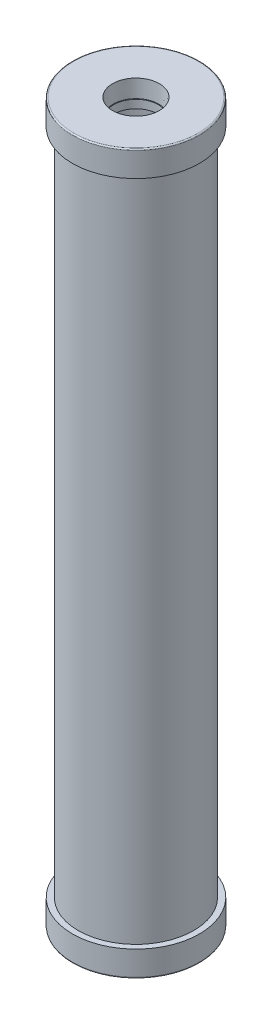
ISO-10303-21;
HEADER;
FILE_DESCRIPTION(('STEP AP214'),'2;1');
FILE_NAME('part.step','',(''),(''),'','','');
FILE_SCHEMA(('AUTOMOTIVE_DESIGN { 1 0 10303 214 1 1 1 1 }'));
ENDSEC;
DATA;
#1=APPLICATION_CONTEXT('core data for automotive mechanical design processes');
#2=APPLICATION_PROTOCOL_DEFINITION('international standard','automotive_design',2000,#1);
#3=PRODUCT_CONTEXT('',#1,'mechanical');
#4=PRODUCT('Part','Part','',(#3));
#5=PRODUCT_RELATED_PRODUCT_CATEGORY('part','',(#4));
#6=PRODUCT_DEFINITION_FORMATION('','',#4);
#7=PRODUCT_DEFINITION_CONTEXT('part definition',#1,'design');
#8=PRODUCT_DEFINITION('design','',#6,#7);
#9=PRODUCT_DEFINITION_SHAPE('','',#8);
#10=(LENGTH_UNIT() NAMED_UNIT(*) SI_UNIT(.MILLI.,.METRE.));
#11=(NAMED_UNIT(*) PLANE_ANGLE_UNIT() SI_UNIT($,.RADIAN.));
#12=(NAMED_UNIT(*) SI_UNIT($,.STERADIAN.) SOLID_ANGLE_UNIT());
#13=UNCERTAINTY_MEASURE_WITH_UNIT(LENGTH_MEASURE(1.E-05),#10,'distance_accuracy_value','');
#14=(GEOMETRIC_REPRESENTATION_CONTEXT(3) GLOBAL_UNCERTAINTY_ASSIGNED_CONTEXT((#13)) GLOBAL_UNIT_ASSIGNED_CONTEXT((#10,
#11,#12)) REPRESENTATION_CONTEXT('',''));
#15=CARTESIAN_POINT('',(0.,0.,0.));
#16=DIRECTION('',(0.,0.,1.));
#17=DIRECTION('',(1.,0.,0.));
#18=AXIS2_PLACEMENT_3D('',#15,#16,#17);
#19=CARTESIAN_POINT('',(0.,711.2,0.));
#20=DIRECTION('',(0.,-1.,0.));
#21=DIRECTION('',(0.,0.,-1.));
#22=AXIS2_PLACEMENT_3D('',#19,#20,#21);
#23=CYLINDRICAL_SURFACE('',#22,57.15);
#24=CARTESIAN_POINT('',(0.,25.4,0.));
#25=DIRECTION('',(0.,1.,0.));
#26=DIRECTION('',(0.,0.,1.));
#27=AXIS2_PLACEMENT_3D('',#24,#25,#26);
#28=CIRCLE('',#27,57.15);
#29=CARTESIAN_POINT('',(0.,25.4,57.15));
#30=VERTEX_POINT('',#29);
#31=EDGE_CURVE('E71',#30,#30,#28,.T.);
#32=ORIENTED_EDGE('',*,*,#31,.T.);
#33=EDGE_LOOP('',(#32));
#34=FACE_BOUND('',#33,.T.);
#35=CARTESIAN_POINT('',(0.,685.8,0.));
#36=DIRECTION('',(0.,1.,0.));
#37=DIRECTION('',(0.,0.,1.));
#38=AXIS2_PLACEMENT_3D('',#35,#36,#37);
#39=CIRCLE('',#38,57.15);
#40=CARTESIAN_POINT('',(0.,685.8,57.15));
#41=VERTEX_POINT('',#40);
#42=EDGE_CURVE('E53',#41,#41,#39,.T.);
#43=ORIENTED_EDGE('',*,*,#42,.F.);
#44=EDGE_LOOP('',(#43));
#45=FACE_BOUND('',#44,.T.);
#46=ADVANCED_FACE('F33',(#34,#45),#23,.T.);
#47=CARTESIAN_POINT('',(0.,711.2,0.));
#48=DIRECTION('',(0.,-1.,0.));
#49=DIRECTION('',(0.,0.,-1.));
#50=AXIS2_PLACEMENT_3D('',#47,#48,#49);
#51=CYLINDRICAL_SURFACE('',#50,50.546);
#52=CARTESIAN_POINT('',(0.,25.4,0.));
#53=DIRECTION('',(0.,1.,0.));
#54=DIRECTION('',(0.,0.,1.));
#55=AXIS2_PLACEMENT_3D('',#52,#53,#54);
#56=CIRCLE('',#55,50.546);
#57=CARTESIAN_POINT('',(0.,25.4,50.546));
#58=VERTEX_POINT('',#57);
#59=EDGE_CURVE('E68',#58,#58,#56,.T.);
#60=ORIENTED_EDGE('',*,*,#59,.F.);
#61=EDGE_LOOP('',(#60));
#62=FACE_BOUND('',#61,.T.);
#63=CARTESIAN_POINT('',(0.,685.8,0.));
#64=DIRECTION('',(0.,1.,0.));
#65=DIRECTION('',(0.,0.,1.));
#66=AXIS2_PLACEMENT_3D('',#63,#64,#65);
#67=CIRCLE('',#66,50.546);
#68=CARTESIAN_POINT('',(0.,685.8,50.546));
#69=VERTEX_POINT('',#68);
#70=EDGE_CURVE('E59',#69,#69,#67,.T.);
#71=ORIENTED_EDGE('',*,*,#70,.T.);
#72=EDGE_LOOP('',(#71));
#73=FACE_BOUND('',#72,.T.);
#74=ADVANCED_FACE('F115',(#62,#73),#51,.F.);
#75=CARTESIAN_POINT('',(0.,25.4,0.));
#76=DIRECTION('',(0.,1.,0.));
#77=DIRECTION('',(0.,0.,1.));
#78=AXIS2_PLACEMENT_3D('',#75,#76,#77);
#79=PLANE('',#78);
#80=CARTESIAN_POINT('',(0.,25.4,0.));
#81=DIRECTION('',(0.,1.,0.));
#82=DIRECTION('',(0.,0.,1.));
#83=AXIS2_PLACEMENT_3D('',#80,#81,#82);
#84=CIRCLE('',#83,21.8313);
#85=CARTESIAN_POINT('',(0.,25.4,21.8313));
#86=VERTEX_POINT('',#85);
#87=EDGE_CURVE('E63',#86,#86,#84,.T.);
#88=ORIENTED_EDGE('',*,*,#87,.F.);
#89=EDGE_LOOP('',(#88));
#90=FACE_BOUND('',#89,.T.);
#91=ORIENTED_EDGE('',*,*,#59,.T.);
#92=EDGE_LOOP('',(#91));
#93=FACE_BOUND('',#92,.T.);
#94=ADVANCED_FACE('F121',(#90,#93),#79,.T.);
#95=CARTESIAN_POINT('',(0.,25.4,0.));
#96=DIRECTION('',(0.,1.,0.));
#97=DIRECTION('',(0.,0.,1.));
#98=AXIS2_PLACEMENT_3D('',#95,#96,#97);
#99=CIRCLE('',#98,62.865);
#100=CARTESIAN_POINT('',(0.,25.4,62.865));
#101=VERTEX_POINT('',#100);
#102=EDGE_CURVE('E66',#101,#101,#99,.T.);
#103=ORIENTED_EDGE('',*,*,#102,.T.);
#104=EDGE_LOOP('',(#103));
#105=FACE_BOUND('',#104,.T.);
#106=ORIENTED_EDGE('',*,*,#31,.F.);
#107=EDGE_LOOP('',(#106));
#108=FACE_BOUND('',#107,.T.);
#109=ADVANCED_FACE('F142',(#105,#108),#79,.T.);
#110=CARTESIAN_POINT('',(0.,25.4,0.));
#111=DIRECTION('',(0.,-1.,0.));
#112=DIRECTION('',(0.,0.,-1.));
#113=AXIS2_PLACEMENT_3D('',#110,#111,#112);
#114=CYLINDRICAL_SURFACE('',#113,62.865);
#115=CARTESIAN_POINT('',(0.,1.27,0.));
#116=DIRECTION('',(0.,1.,0.));
#117=DIRECTION('',(0.,0.,1.));
#118=AXIS2_PLACEMENT_3D('',#115,#116,#117);
#119=CIRCLE('',#118,62.865);
#120=CARTESIAN_POINT('',(0.,1.27,62.865));
#121=VERTEX_POINT('',#120);
#122=EDGE_CURVE('E48',#121,#121,#119,.T.);
#123=ORIENTED_EDGE('',*,*,#122,.T.);
#124=EDGE_LOOP('',(#123));
#125=FACE_BOUND('',#124,.T.);
#126=ORIENTED_EDGE('',*,*,#102,.F.);
#127=EDGE_LOOP('',(#126));
#128=FACE_BOUND('',#127,.T.);
#129=ADVANCED_FACE('F139',(#125,#128),#114,.T.);
#130=CARTESIAN_POINT('',(0.,0.,0.));
#131=DIRECTION('',(0.,1.,0.));
#132=DIRECTION('',(0.,0.,1.));
#133=AXIS2_PLACEMENT_3D('',#130,#131,#132);
#134=PLANE('',#133);
#135=CARTESIAN_POINT('',(0.,0.,0.));
#136=DIRECTION('',(0.,1.,0.));
#137=DIRECTION('',(0.,0.,1.));
#138=AXIS2_PLACEMENT_3D('',#135,#136,#137);
#139=CIRCLE('',#138,61.595);
#140=CARTESIAN_POINT('',(0.,0.,61.595));
#141=VERTEX_POINT('',#140);
#142=EDGE_CURVE('E44',#141,#141,#139,.F.);
#143=ORIENTED_EDGE('',*,*,#142,.T.);
#144=EDGE_LOOP('',(#143));
#145=FACE_BOUND('',#144,.T.);
#146=CARTESIAN_POINT('',(0.,0.,0.));
#147=DIRECTION('',(0.,-1.,0.));
#148=DIRECTION('',(0.,0.,-1.));
#149=AXIS2_PLACEMENT_3D('',#146,#147,#148);
#150=CIRCLE('',#149,23.1430322);
#151=CARTESIAN_POINT('',(0.,0.,-23.1430322));
#152=VERTEX_POINT('',#151);
#153=EDGE_CURVE('E62',#152,#152,#150,.T.);
#154=ORIENTED_EDGE('',*,*,#153,.F.);
#155=EDGE_LOOP('',(#154));
#156=FACE_BOUND('',#155,.T.);
#157=ADVANCED_FACE('F124',(#145,#156),#134,.F.);
#158=CARTESIAN_POINT('',(0.,0.,0.));
#159=DIRECTION('',(0.,-1.,0.));
#160=DIRECTION('',(0.,0.,-1.));
#161=AXIS2_PLACEMENT_3D('',#158,#159,#160);
#162=CYLINDRICAL_SURFACE('',#161,21.8313);
#163=ORIENTED_EDGE('',*,*,#87,.T.);
#164=EDGE_LOOP('',(#163));
#165=FACE_BOUND('',#164,.T.);
#166=CARTESIAN_POINT('',(0.,17.272,0.));
#167=DIRECTION('',(0.,-1.,0.));
#168=DIRECTION('',(0.,0.,-1.));
#169=AXIS2_PLACEMENT_3D('',#166,#167,#168);
#170=CIRCLE('',#169,21.8313);
#171=CARTESIAN_POINT('',(0.,17.272,-21.8313));
#172=VERTEX_POINT('',#171);
#173=EDGE_CURVE('E67',#172,#172,#170,.T.);
#174=ORIENTED_EDGE('',*,*,#173,.T.);
#175=EDGE_LOOP('',(#174));
#176=FACE_BOUND('',#175,.T.);
#177=ADVANCED_FACE('F155',(#165,#176),#162,.F.);
#178=CARTESIAN_POINT('',(21.8313,17.272,0.));
#179=DIRECTION('',(0.,1.,0.));
#180=DIRECTION('',(0.,0.,1.));
#181=AXIS2_PLACEMENT_3D('',#178,#179,#180);
#182=PLANE('',#181);
#183=ORIENTED_EDGE('',*,*,#173,.F.);
#184=EDGE_LOOP('',(#183));
#185=FACE_BOUND('',#184,.T.);
#186=CARTESIAN_POINT('',(0.,17.272,0.));
#187=DIRECTION('',(0.,-1.,0.));
#188=DIRECTION('',(0.,0.,-1.));
#189=AXIS2_PLACEMENT_3D('',#186,#187,#188);
#190=CIRCLE('',#189,22.6258853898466);
#191=CARTESIAN_POINT('',(0.,17.272,-22.6258853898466));
#192=VERTEX_POINT('',#191);
#193=EDGE_CURVE('E78',#192,#192,#190,.T.);
#194=ORIENTED_EDGE('',*,*,#193,.T.);
#195=EDGE_LOOP('',(#194));
#196=FACE_BOUND('',#195,.T.);
#197=ADVANCED_FACE('F158',(#185,#196),#182,.F.);
#198=CARTESIAN_POINT('',(0.,0.,0.));
#199=DIRECTION('',(0.,-1.,0.));
#200=DIRECTION('',(0.,0.,-1.));
#201=AXIS2_PLACEMENT_3D('',#198,#199,#200);
#202=CONICAL_SURFACE('',#201,23.1430322,0.0299323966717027);
#203=ORIENTED_EDGE('',*,*,#193,.F.);
#204=EDGE_LOOP('',(#203));
#205=FACE_BOUND('',#204,.T.);
#206=ORIENTED_EDGE('',*,*,#153,.T.);
#207=EDGE_LOOP('',(#206));
#208=FACE_BOUND('',#207,.T.);
#209=ADVANCED_FACE('F162',(#205,#208),#202,.F.);
#210=CARTESIAN_POINT('',(0.,685.8,0.));
#211=DIRECTION('',(0.,1.,0.));
#212=DIRECTION('',(0.,0.,1.));
#213=AXIS2_PLACEMENT_3D('',#210,#211,#212);
#214=PLANE('',#213);
#215=CARTESIAN_POINT('',(0.,685.8,0.));
#216=DIRECTION('',(0.,1.,0.));
#217=DIRECTION('',(0.,0.,1.));
#218=AXIS2_PLACEMENT_3D('',#215,#216,#217);
#219=CIRCLE('',#218,21.8313);
#220=CARTESIAN_POINT('',(0.,685.8,21.8313));
#221=VERTEX_POINT('',#220);
#222=EDGE_CURVE('E54',#221,#221,#219,.T.);
#223=ORIENTED_EDGE('',*,*,#222,.T.);
#224=EDGE_LOOP('',(#223));
#225=FACE_BOUND('',#224,.T.);
#226=ORIENTED_EDGE('',*,*,#70,.F.);
#227=EDGE_LOOP('',(#226));
#228=FACE_BOUND('',#227,.T.);
#229=ADVANCED_FACE('F165',(#225,#228),#214,.F.);
#230=CARTESIAN_POINT('',(0.,685.8,0.));
#231=DIRECTION('',(0.,1.,0.));
#232=DIRECTION('',(0.,0.,1.));
#233=AXIS2_PLACEMENT_3D('',#230,#231,#232);
#234=CIRCLE('',#233,62.865);
#235=CARTESIAN_POINT('',(0.,685.8,62.865));
#236=VERTEX_POINT('',#235);
#237=EDGE_CURVE('E57',#236,#236,#234,.T.);
#238=ORIENTED_EDGE('',*,*,#237,.F.);
#239=EDGE_LOOP('',(#238));
#240=FACE_BOUND('',#239,.T.);
#241=ORIENTED_EDGE('',*,*,#42,.T.);
#242=EDGE_LOOP('',(#241));
#243=FACE_BOUND('',#242,.T.);
#244=ADVANCED_FACE('F110',(#240,#243),#214,.F.);
#245=CARTESIAN_POINT('',(0.,685.8,0.));
#246=DIRECTION('',(0.,1.,0.));
#247=DIRECTION('',(0.,0.,1.));
#248=AXIS2_PLACEMENT_3D('',#245,#246,#247);
#249=CYLINDRICAL_SURFACE('',#248,62.865);
#250=CARTESIAN_POINT('',(0.,709.93,0.));
#251=DIRECTION('',(0.,1.,0.));
#252=DIRECTION('',(0.,0.,1.));
#253=AXIS2_PLACEMENT_3D('',#250,#251,#252);
#254=CIRCLE('',#253,62.865);
#255=CARTESIAN_POINT('',(0.,709.93,62.865));
#256=VERTEX_POINT('',#255);
#257=EDGE_CURVE('E10',#256,#256,#254,.F.);
#258=ORIENTED_EDGE('',*,*,#257,.T.);
#259=EDGE_LOOP('',(#258));
#260=FACE_BOUND('',#259,.T.);
#261=ORIENTED_EDGE('',*,*,#237,.T.);
#262=EDGE_LOOP('',(#261));
#263=FACE_BOUND('',#262,.T.);
#264=ADVANCED_FACE('F101',(#260,#263),#249,.T.);
#265=CARTESIAN_POINT('',(0.,711.2,0.));
#266=DIRECTION('',(0.,1.,0.));
#267=DIRECTION('',(0.,0.,1.));
#268=AXIS2_PLACEMENT_3D('',#265,#266,#267);
#269=PLANE('',#268);
#270=CARTESIAN_POINT('',(0.,711.2,0.));
#271=DIRECTION('',(0.,1.,0.));
#272=DIRECTION('',(0.,0.,1.));
#273=AXIS2_PLACEMENT_3D('',#270,#271,#272);
#274=CIRCLE('',#273,61.595);
#275=CARTESIAN_POINT('',(0.,711.2,61.595));
#276=VERTEX_POINT('',#275);
#277=EDGE_CURVE('E40',#276,#276,#274,.T.);
#278=ORIENTED_EDGE('',*,*,#277,.T.);
#279=EDGE_LOOP('',(#278));
#280=FACE_BOUND('',#279,.T.);
#281=CARTESIAN_POINT('',(0.,711.2,0.));
#282=DIRECTION('',(0.,1.,0.));
#283=DIRECTION('',(0.,0.,1.));
#284=AXIS2_PLACEMENT_3D('',#281,#282,#283);
#285=CIRCLE('',#284,23.1430322);
#286=CARTESIAN_POINT('',(0.,711.2,23.1430322));
#287=VERTEX_POINT('',#286);
#288=EDGE_CURVE('E92',#287,#287,#285,.T.);
#289=ORIENTED_EDGE('',*,*,#288,.F.);
#290=EDGE_LOOP('',(#289));
#291=FACE_BOUND('',#290,.T.);
#292=ADVANCED_FACE('F98',(#280,#291),#269,.T.);
#293=CARTESIAN_POINT('',(0.,711.2,0.));
#294=DIRECTION('',(0.,1.,0.));
#295=DIRECTION('',(0.,0.,1.));
#296=AXIS2_PLACEMENT_3D('',#293,#294,#295);
#297=CYLINDRICAL_SURFACE('',#296,21.8313);
#298=CARTESIAN_POINT('',(0.,693.928,0.));
#299=DIRECTION('',(0.,1.,0.));
#300=DIRECTION('',(0.,0.,1.));
#301=AXIS2_PLACEMENT_3D('',#298,#299,#300);
#302=CIRCLE('',#301,21.8313);
#303=CARTESIAN_POINT('',(0.,693.928,21.8313));
#304=VERTEX_POINT('',#303);
#305=EDGE_CURVE('E58',#304,#304,#302,.T.);
#306=ORIENTED_EDGE('',*,*,#305,.T.);
#307=EDGE_LOOP('',(#306));
#308=FACE_BOUND('',#307,.T.);
#309=ORIENTED_EDGE('',*,*,#222,.F.);
#310=EDGE_LOOP('',(#309));
#311=FACE_BOUND('',#310,.T.);
#312=ADVANCED_FACE('F100',(#308,#311),#297,.F.);
#313=CARTESIAN_POINT('',(21.8313,693.928,0.));
#314=DIRECTION('',(0.,-1.,0.));
#315=DIRECTION('',(0.,0.,-1.));
#316=AXIS2_PLACEMENT_3D('',#313,#314,#315);
#317=PLANE('',#316);
#318=ORIENTED_EDGE('',*,*,#305,.F.);
#319=EDGE_LOOP('',(#318));
#320=FACE_BOUND('',#319,.T.);
#321=CARTESIAN_POINT('',(0.,693.928,0.));
#322=DIRECTION('',(0.,1.,0.));
#323=DIRECTION('',(0.,0.,1.));
#324=AXIS2_PLACEMENT_3D('',#321,#322,#323);
#325=CIRCLE('',#324,22.6258853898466);
#326=CARTESIAN_POINT('',(0.,693.928,22.6258853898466));
#327=VERTEX_POINT('',#326);
#328=EDGE_CURVE('E89',#327,#327,#325,.T.);
#329=ORIENTED_EDGE('',*,*,#328,.T.);
#330=EDGE_LOOP('',(#329));
#331=FACE_BOUND('',#330,.T.);
#332=ADVANCED_FACE('F107',(#320,#331),#317,.F.);
#333=CARTESIAN_POINT('',(0.,711.2,0.));
#334=DIRECTION('',(0.,1.,0.));
#335=DIRECTION('',(0.,0.,1.));
#336=AXIS2_PLACEMENT_3D('',#333,#334,#335);
#337=CONICAL_SURFACE('',#336,23.1430322,0.0299323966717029);
#338=ORIENTED_EDGE('',*,*,#328,.F.);
#339=EDGE_LOOP('',(#338));
#340=FACE_BOUND('',#339,.T.);
#341=ORIENTED_EDGE('',*,*,#288,.T.);
#342=EDGE_LOOP('',(#341));
#343=FACE_BOUND('',#342,.T.);
#344=ADVANCED_FACE('F96',(#340,#343),#337,.F.);
#345=CARTESIAN_POINT('',(0.,1.27,0.));
#346=DIRECTION('',(0.,1.,0.));
#347=DIRECTION('',(0.,0.,1.));
#348=AXIS2_PLACEMENT_3D('',#345,#346,#347);
#349=TOROIDAL_SURFACE('',#348,61.595,1.27);
#350=ORIENTED_EDGE('',*,*,#142,.F.);
#351=EDGE_LOOP('',(#350));
#352=FACE_BOUND('',#351,.T.);
#353=ORIENTED_EDGE('',*,*,#122,.F.);
#354=EDGE_LOOP('',(#353));
#355=FACE_BOUND('',#354,.T.);
#356=ADVANCED_FACE('F125',(#352,#355),#349,.T.);
#357=CARTESIAN_POINT('',(0.,709.93,0.));
#358=DIRECTION('',(0.,1.,0.));
#359=DIRECTION('',(0.,0.,1.));
#360=AXIS2_PLACEMENT_3D('',#357,#358,#359);
#361=TOROIDAL_SURFACE('',#360,61.595,1.27);
#362=ORIENTED_EDGE('',*,*,#257,.F.);
#363=EDGE_LOOP('',(#362));
#364=FACE_BOUND('',#363,.T.);
#365=ORIENTED_EDGE('',*,*,#277,.F.);
#366=EDGE_LOOP('',(#365));
#367=FACE_BOUND('',#366,.T.);
#368=ADVANCED_FACE('F35',(#364,#367),#361,.T.);
#369=CLOSED_SHELL('',(#46,#74,#94,#109,#129,#157,#177,#197,#209,#229,#244,#264,#292,#312,#332,
#344,#356,#368));
#370=MANIFOLD_SOLID_BREP('B2',#369);
#371=ADVANCED_BREP_SHAPE_REPRESENTATION('',(#18,#370),#14);
#372=SHAPE_DEFINITION_REPRESENTATION(#9,#371);
ENDSEC;
END-ISO-10303-21;
